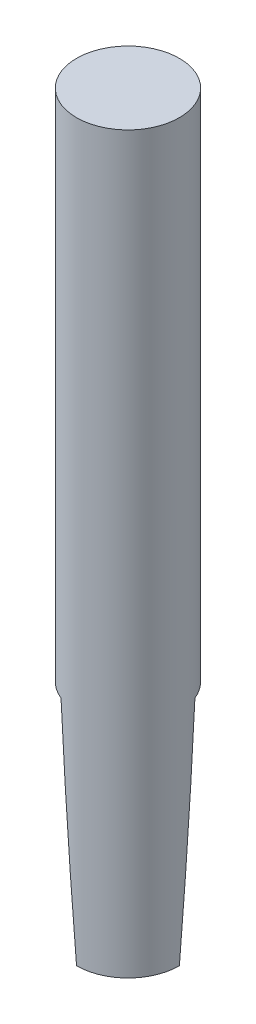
ISO-10303-21;
HEADER;
FILE_DESCRIPTION(('STEP AP214'),'2;1');
FILE_NAME('part.step','',(''),(''),'','','');
FILE_SCHEMA(('AUTOMOTIVE_DESIGN { 1 0 10303 214 1 1 1 1 }'));
ENDSEC;
DATA;
#1=APPLICATION_CONTEXT('core data for automotive mechanical design processes');
#2=APPLICATION_PROTOCOL_DEFINITION('international standard','automotive_design',2000,#1);
#3=PRODUCT_CONTEXT('',#1,'mechanical');
#4=PRODUCT('Part','Part','',(#3));
#5=PRODUCT_RELATED_PRODUCT_CATEGORY('part','',(#4));
#6=PRODUCT_DEFINITION_FORMATION('','',#4);
#7=PRODUCT_DEFINITION_CONTEXT('part definition',#1,'design');
#8=PRODUCT_DEFINITION('design','',#6,#7);
#9=PRODUCT_DEFINITION_SHAPE('','',#8);
#10=(LENGTH_UNIT() NAMED_UNIT(*) SI_UNIT(.MILLI.,.METRE.));
#11=(NAMED_UNIT(*) PLANE_ANGLE_UNIT() SI_UNIT($,.RADIAN.));
#12=(NAMED_UNIT(*) SI_UNIT($,.STERADIAN.) SOLID_ANGLE_UNIT());
#13=UNCERTAINTY_MEASURE_WITH_UNIT(LENGTH_MEASURE(1.E-05),#10,'distance_accuracy_value','');
#14=(GEOMETRIC_REPRESENTATION_CONTEXT(3) GLOBAL_UNCERTAINTY_ASSIGNED_CONTEXT((#13)) GLOBAL_UNIT_ASSIGNED_CONTEXT((#10,
#11,#12)) REPRESENTATION_CONTEXT('',''));
#15=CARTESIAN_POINT('',(0.,0.,0.));
#16=DIRECTION('',(0.,0.,1.));
#17=DIRECTION('',(1.,0.,0.));
#18=AXIS2_PLACEMENT_3D('',#15,#16,#17);
#19=CARTESIAN_POINT('',(30.,70.,-140.));
#20=DIRECTION('',(0.,-1.,0.));
#21=DIRECTION('',(0.,0.,-1.));
#22=AXIS2_PLACEMENT_3D('',#19,#20,#21);
#23=CYLINDRICAL_SURFACE('',#22,3.5);
#24=CARTESIAN_POINT('',(30.,70.,-140.));
#25=DIRECTION('',(0.,1.,0.));
#26=DIRECTION('',(0.,0.,1.));
#27=AXIS2_PLACEMENT_3D('',#24,#25,#26);
#28=CIRCLE('',#27,3.5);
#29=CARTESIAN_POINT('',(30.,70.,-136.5));
#30=VERTEX_POINT('',#29);
#31=EDGE_CURVE('E123',#30,#30,#28,.T.);
#32=ORIENTED_EDGE('',*,*,#31,.F.);
#33=EDGE_LOOP('',(#32));
#34=FACE_BOUND('',#33,.T.);
#35=CARTESIAN_POINT('',(30.,20.,-140.));
#36=DIRECTION('',(0.,0.0871557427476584,-0.996194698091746));
#37=DIRECTION('',(0.,-0.996194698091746,-0.0871557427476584));
#38=AXIS2_PLACEMENT_3D('',#35,#36,#37);
#39=ELLIPSE('',#38,40.1579963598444,3.5);
#40=CARTESIAN_POINT('',(26.7553443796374,35.,-138.687670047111));
#41=VERTEX_POINT('',#40);
#42=CARTESIAN_POINT('',(26.5,20.,-140.));
#43=VERTEX_POINT('',#42);
#44=EDGE_CURVE('E107',#41,#43,#39,.F.);
#45=ORIENTED_EDGE('',*,*,#44,.F.);
#46=CARTESIAN_POINT('',(30.,35.,-140.));
#47=DIRECTION('',(0.,-1.,0.));
#48=DIRECTION('',(0.,0.,-1.));
#49=AXIS2_PLACEMENT_3D('',#46,#47,#48);
#50=CIRCLE('',#49,3.5);
#51=CARTESIAN_POINT('',(28.6876700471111,35.,-136.755344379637));
#52=VERTEX_POINT('',#51);
#53=EDGE_CURVE('E11',#52,#41,#50,.T.);
#54=ORIENTED_EDGE('',*,*,#53,.F.);
#55=CARTESIAN_POINT('',(30.,20.,-140.));
#56=DIRECTION('',(0.996194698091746,0.0871557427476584,0.));
#57=DIRECTION('',(0.0871557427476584,-0.996194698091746,0.));
#58=AXIS2_PLACEMENT_3D('',#55,#56,#57);
#59=ELLIPSE('',#58,40.1579963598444,3.5);
#60=CARTESIAN_POINT('',(30.,20.,-136.5));
#61=VERTEX_POINT('',#60);
#62=EDGE_CURVE('E94',#52,#61,#59,.T.);
#63=ORIENTED_EDGE('',*,*,#62,.T.);
#64=CARTESIAN_POINT('',(30.,20.,-140.));
#65=DIRECTION('',(0.,1.,0.));
#66=DIRECTION('',(0.,0.,1.));
#67=AXIS2_PLACEMENT_3D('',#64,#65,#66);
#68=CIRCLE('',#67,3.5);
#69=CARTESIAN_POINT('',(33.5,20.,-140.));
#70=VERTEX_POINT('',#69);
#71=EDGE_CURVE('E48',#61,#70,#68,.T.);
#72=ORIENTED_EDGE('',*,*,#71,.T.);
#73=CARTESIAN_POINT('',(30.,20.,-140.));
#74=DIRECTION('',(0.,0.0871557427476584,0.996194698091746));
#75=DIRECTION('',(0.,-0.996194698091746,0.0871557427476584));
#76=AXIS2_PLACEMENT_3D('',#73,#74,#75);
#77=ELLIPSE('',#76,40.1579963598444,3.5);
#78=CARTESIAN_POINT('',(33.2446556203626,35.,-141.312329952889));
#79=VERTEX_POINT('',#78);
#80=EDGE_CURVE('E116',#79,#70,#77,.F.);
#81=ORIENTED_EDGE('',*,*,#80,.F.);
#82=CARTESIAN_POINT('',(30.,35.,-140.));
#83=DIRECTION('',(0.,-1.,0.));
#84=DIRECTION('',(0.,0.,-1.));
#85=AXIS2_PLACEMENT_3D('',#82,#83,#84);
#86=CIRCLE('',#85,3.5);
#87=CARTESIAN_POINT('',(31.3123299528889,35.,-143.244655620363));
#88=VERTEX_POINT('',#87);
#89=EDGE_CURVE('E41',#88,#79,#86,.T.);
#90=ORIENTED_EDGE('',*,*,#89,.F.);
#91=CARTESIAN_POINT('',(30.,20.,-140.));
#92=DIRECTION('',(-0.996194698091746,0.0871557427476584,0.));
#93=DIRECTION('',(-0.0871557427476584,-0.996194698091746,0.));
#94=AXIS2_PLACEMENT_3D('',#91,#92,#93);
#95=ELLIPSE('',#94,40.1579963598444,3.5);
#96=CARTESIAN_POINT('',(30.,20.,-143.5));
#97=VERTEX_POINT('',#96);
#98=EDGE_CURVE('E56',#97,#88,#95,.F.);
#99=ORIENTED_EDGE('',*,*,#98,.F.);
#100=EDGE_CURVE('E127',#97,#43,#68,.T.);
#101=ORIENTED_EDGE('',*,*,#100,.T.);
#102=EDGE_LOOP('',(#45,#54,#63,#72,#81,#90,#99,#101));
#103=FACE_BOUND('',#102,.T.);
#104=ADVANCED_FACE('F34',(#34,#103),#23,.T.);
#105=CARTESIAN_POINT('',(30.,20.,-140.));
#106=DIRECTION('',(0.,1.,0.));
#107=DIRECTION('',(0.,0.,1.));
#108=AXIS2_PLACEMENT_3D('',#105,#106,#107);
#109=PLANE('',#108);
#110=DIRECTION('',(-1.,0.,0.));
#111=VECTOR('',#110,1.);
#112=CARTESIAN_POINT('',(0.,20.,-140.));
#113=LINE('',#112,#111);
#114=CARTESIAN_POINT('',(30.,20.,-140.));
#115=VERTEX_POINT('',#114);
#116=EDGE_CURVE('E90',#115,#43,#113,.T.);
#117=ORIENTED_EDGE('',*,*,#116,.T.);
#118=ORIENTED_EDGE('',*,*,#100,.F.);
#119=DIRECTION('',(0.,0.,1.));
#120=VECTOR('',#119,1.);
#121=CARTESIAN_POINT('',(30.,20.,-140.));
#122=LINE('',#121,#120);
#123=EDGE_CURVE('E126',#115,#97,#122,.F.);
#124=ORIENTED_EDGE('',*,*,#123,.F.);
#125=EDGE_LOOP('',(#117,#118,#124));
#126=FACE_BOUND('',#125,.T.);
#127=ADVANCED_FACE('F139',(#126),#109,.F.);
#128=ORIENTED_EDGE('',*,*,#71,.F.);
#129=DIRECTION('',(0.,0.,1.));
#130=VECTOR('',#129,1.);
#131=CARTESIAN_POINT('',(30.,20.,0.));
#132=LINE('',#131,#130);
#133=EDGE_CURVE('E101',#115,#61,#132,.T.);
#134=ORIENTED_EDGE('',*,*,#133,.F.);
#135=DIRECTION('',(1.,0.,0.));
#136=VECTOR('',#135,1.);
#137=CARTESIAN_POINT('',(0.,20.,-140.));
#138=LINE('',#137,#136);
#139=EDGE_CURVE('E109',#115,#70,#138,.T.);
#140=ORIENTED_EDGE('',*,*,#139,.T.);
#141=EDGE_LOOP('',(#128,#134,#140));
#142=FACE_BOUND('',#141,.T.);
#143=ADVANCED_FACE('F144',(#142),#109,.F.);
#144=CARTESIAN_POINT('',(30.,70.,-140.));
#145=DIRECTION('',(0.,1.,0.));
#146=DIRECTION('',(0.,0.,1.));
#147=AXIS2_PLACEMENT_3D('',#144,#145,#146);
#148=PLANE('',#147);
#149=ORIENTED_EDGE('',*,*,#31,.T.);
#150=EDGE_LOOP('',(#149));
#151=FACE_BOUND('',#150,.T.);
#152=ADVANCED_FACE('F148',(#151),#148,.T.);
#153=CARTESIAN_POINT('',(0.,35.,0.));
#154=DIRECTION('',(0.,-1.,0.));
#155=DIRECTION('',(0.,0.,-1.));
#156=AXIS2_PLACEMENT_3D('',#153,#154,#155);
#157=PLANE('',#156);
#158=ORIENTED_EDGE('',*,*,#89,.T.);
#159=DIRECTION('',(-1.,0.,0.));
#160=VECTOR('',#159,1.);
#161=CARTESIAN_POINT('',(0.,35.,-141.312329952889));
#162=LINE('',#161,#160);
#163=CARTESIAN_POINT('',(31.3123299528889,35.,-141.312329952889));
#164=VERTEX_POINT('',#163);
#165=EDGE_CURVE('E117',#164,#79,#162,.F.);
#166=ORIENTED_EDGE('',*,*,#165,.F.);
#167=DIRECTION('',(0.,0.,-1.));
#168=VECTOR('',#167,1.);
#169=CARTESIAN_POINT('',(31.3123299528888,35.,0.));
#170=LINE('',#169,#168);
#171=EDGE_CURVE('E112',#88,#164,#170,.F.);
#172=ORIENTED_EDGE('',*,*,#171,.F.);
#173=EDGE_LOOP('',(#158,#166,#172));
#174=FACE_BOUND('',#173,.T.);
#175=ADVANCED_FACE('F133',(#174),#157,.T.);
#176=CARTESIAN_POINT('',(29.9999999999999,20.,0.));
#177=DIRECTION('',(-0.996194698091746,0.0871557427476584,0.));
#178=DIRECTION('',(-0.0871557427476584,-0.996194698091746,0.));
#179=AXIS2_PLACEMENT_3D('',#176,#177,#178);
#180=PLANE('',#179);
#181=ORIENTED_EDGE('',*,*,#98,.T.);
#182=ORIENTED_EDGE('',*,*,#171,.T.);
#183=DIRECTION('',(-0.0868265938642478,-0.992432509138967,0.0868265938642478));
#184=VECTOR('',#183,1.);
#185=CARTESIAN_POINT('',(29.773834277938,17.4149139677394,-139.773834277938));
#186=LINE('',#185,#184);
#187=EDGE_CURVE('E113',#164,#115,#186,.T.);
#188=ORIENTED_EDGE('',*,*,#187,.T.);
#189=ORIENTED_EDGE('',*,*,#123,.T.);
#190=EDGE_LOOP('',(#181,#182,#188,#189));
#191=FACE_BOUND('',#190,.T.);
#192=ADVANCED_FACE('F155',(#191),#180,.F.);
#193=CARTESIAN_POINT('',(0.,20.,-140.));
#194=DIRECTION('',(0.,0.0871557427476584,0.996194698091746));
#195=DIRECTION('',(0.,-0.996194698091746,0.0871557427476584));
#196=AXIS2_PLACEMENT_3D('',#193,#194,#195);
#197=PLANE('',#196);
#198=ORIENTED_EDGE('',*,*,#80,.T.);
#199=ORIENTED_EDGE('',*,*,#139,.F.);
#200=ORIENTED_EDGE('',*,*,#187,.F.);
#201=ORIENTED_EDGE('',*,*,#165,.T.);
#202=EDGE_LOOP('',(#198,#199,#200,#201));
#203=FACE_BOUND('',#202,.T.);
#204=ADVANCED_FACE('F136',(#203),#197,.F.);
#205=CARTESIAN_POINT('',(0.,35.,0.));
#206=DIRECTION('',(0.,-1.,0.));
#207=DIRECTION('',(0.,0.,-1.));
#208=AXIS2_PLACEMENT_3D('',#205,#206,#207);
#209=PLANE('',#208);
#210=ORIENTED_EDGE('',*,*,#53,.T.);
#211=DIRECTION('',(1.,0.,0.));
#212=VECTOR('',#211,1.);
#213=CARTESIAN_POINT('',(0.,35.,-138.687670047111));
#214=LINE('',#213,#212);
#215=CARTESIAN_POINT('',(28.6876700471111,35.,-138.687670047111));
#216=VERTEX_POINT('',#215);
#217=EDGE_CURVE('E87',#216,#41,#214,.F.);
#218=ORIENTED_EDGE('',*,*,#217,.F.);
#219=DIRECTION('',(0.,0.,1.));
#220=VECTOR('',#219,1.);
#221=CARTESIAN_POINT('',(28.6876700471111,35.,0.));
#222=LINE('',#221,#220);
#223=EDGE_CURVE('E95',#216,#52,#222,.T.);
#224=ORIENTED_EDGE('',*,*,#223,.T.);
#225=EDGE_LOOP('',(#210,#218,#224));
#226=FACE_BOUND('',#225,.T.);
#227=ADVANCED_FACE('F99',(#226),#209,.T.);
#228=CARTESIAN_POINT('',(0.,20.,-140.));
#229=DIRECTION('',(0.,0.0871557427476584,-0.996194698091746));
#230=DIRECTION('',(0.,0.996194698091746,0.0871557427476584));
#231=AXIS2_PLACEMENT_3D('',#228,#229,#230);
#232=PLANE('',#231);
#233=ORIENTED_EDGE('',*,*,#44,.T.);
#234=ORIENTED_EDGE('',*,*,#116,.F.);
#235=DIRECTION('',(-0.0868265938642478,0.992432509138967,0.0868265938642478));
#236=VECTOR('',#235,1.);
#237=CARTESIAN_POINT('',(28.9445599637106,32.063734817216,-138.944559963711));
#238=LINE('',#237,#236);
#239=EDGE_CURVE('E84',#216,#115,#238,.F.);
#240=ORIENTED_EDGE('',*,*,#239,.F.);
#241=ORIENTED_EDGE('',*,*,#217,.T.);
#242=EDGE_LOOP('',(#233,#234,#240,#241));
#243=FACE_BOUND('',#242,.T.);
#244=ADVANCED_FACE('F86',(#243),#232,.F.);
#245=CARTESIAN_POINT('',(30.,20.,0.));
#246=DIRECTION('',(0.996194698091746,0.0871557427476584,0.));
#247=DIRECTION('',(-0.0871557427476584,0.996194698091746,0.));
#248=AXIS2_PLACEMENT_3D('',#245,#246,#247);
#249=PLANE('',#248);
#250=ORIENTED_EDGE('',*,*,#223,.F.);
#251=ORIENTED_EDGE('',*,*,#239,.T.);
#252=ORIENTED_EDGE('',*,*,#133,.T.);
#253=ORIENTED_EDGE('',*,*,#62,.F.);
#254=EDGE_LOOP('',(#250,#251,#252,#253));
#255=FACE_BOUND('',#254,.T.);
#256=ADVANCED_FACE('F103',(#255),#249,.F.);
#257=CLOSED_SHELL('',(#104,#127,#143,#152,#175,#192,#204,#227,#244,#256));
#258=MANIFOLD_SOLID_BREP('B2',#257);
#259=ADVANCED_BREP_SHAPE_REPRESENTATION('',(#18,#258),#14);
#260=SHAPE_DEFINITION_REPRESENTATION(#9,#259);
ENDSEC;
END-ISO-10303-21;
